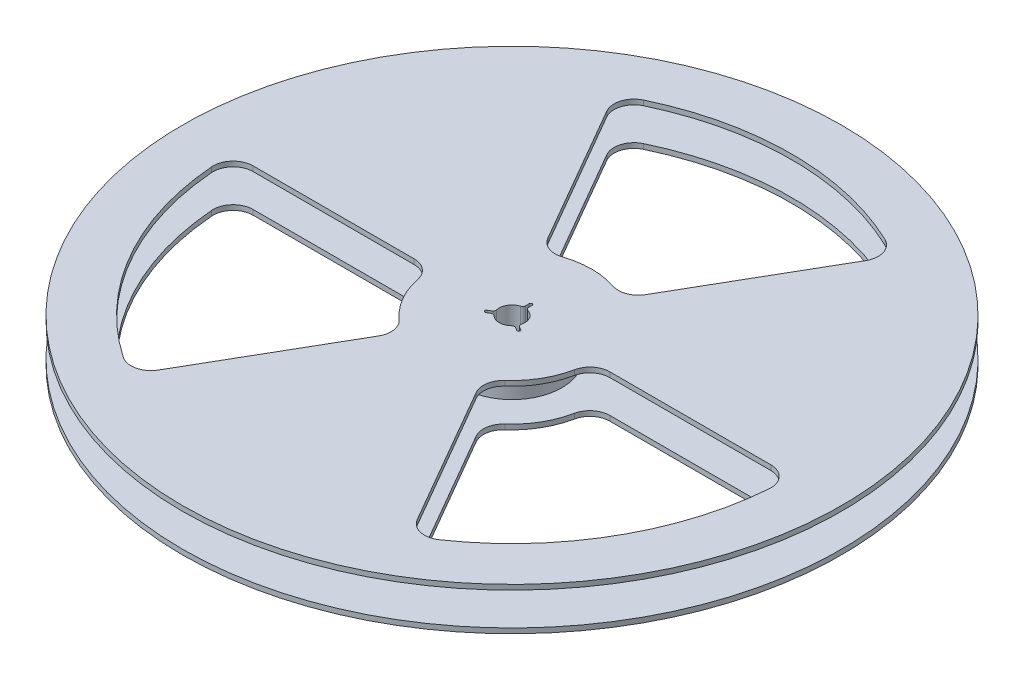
from build123d import *

# Parameters (mm, degrees)
CUT_EXTRUDE1_DEPTH = 235.324475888
CUT_EXTRUDE2_DEPTH = 235.324475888


with BuildPart() as part:
    # Sketch1 → Revolve1 (revolve)
    with BuildSketch(Plane.XY, mode=Mode.PRIVATE) as revolve1_sk:
        Polygon((0, 8.2), (0, -8.2), (0, -10.7), (165, -10.7), (165, -8.2), (25, -8.2), (25, 8.2), (165, 8.2), (165, 10.7), (0, 10.7), align=None)
    revolve(revolve1_sk.sketch.rotate(Axis((0, 8.2, 0), (0, -1, 0)), 90), axis=Axis((0, 8.2, 0), (0, -1, 0)))

    # Sketch2 → Cut-Extrude1 (cut, through all)
    with BuildSketch(Plane(origin=(0, 10.7, 0), x_dir=(1, 0, 0), z_dir=(0, 1, 0))):
        with BuildLine():
            Line((-0.75, 9.35), (-0.75, 7.572813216))
            ThreePointArc((-0.75, 7.572813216), (-1.047747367, 6.675824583), (-1.82278481, 6.134937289))
            ThreePointArc((-1.82278481, 6.134937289), (-5.542562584, 3.2), (-6.224403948, -1.488890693))
            ThreePointArc((-6.224403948, -1.488890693), (-6.305307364, -2.430536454), (-6.933248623, -3.136887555))
            Line((-6.933248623, -3.136887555), (-8.472337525, -4.025480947))
            ThreePointArc((-8.472337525, -4.025480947), (-8.746856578, -5.05), (-7.722337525, -5.324519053))
            Line((-7.722337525, -5.324519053), (-6.183248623, -4.435925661))
            ThreePointArc((-6.183248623, -4.435925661), (-5.257559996, -4.245288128), (-4.401619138, -4.646046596))
            ThreePointArc((-4.401619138, -4.646046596), (0, -6.4), (4.401619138, -4.646046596))
            ThreePointArc((4.401619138, -4.646046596), (5.257559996, -4.245288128), (6.183248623, -4.435925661))
            Line((6.183248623, -4.435925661), (7.722337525, -5.324519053))
            ThreePointArc((7.722337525, -5.324519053), (8.746856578, -5.05), (8.472337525, -4.025480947))
            Line((8.472337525, -4.025480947), (6.933248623, -3.136887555))
            ThreePointArc((6.933248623, -3.136887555), (6.305307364, -2.430536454), (6.224403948, -1.488890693))
            ThreePointArc((6.224403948, -1.488890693), (5.542562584, 3.2), (1.82278481, 6.134937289))
            ThreePointArc((1.82278481, 6.134937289), (1.047747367, 6.675824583), (0.75, 7.572813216))
            Line((0.75, 7.572813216), (0.75, 9.35))
            ThreePointArc((0.75, 9.35), (0, 10.1), (-0.75, 9.35))
        make_face()
    extrude(amount=-CUT_EXTRUDE1_DEPTH, mode=Mode.SUBTRACT)

    # Sketch3 → Cut-Extrude2 (cut, through all)
    with BuildSketch(Plane(origin=(0, 10.7, 0), x_dir=(1, 0, 0), z_dir=(0, 1, 0))):
        with BuildLine():
            Line((48.989794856, 0), (129.614813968, 0))
            ThreePointArc((129.614813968, 0), (136.952807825, -3.206337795), (139.585184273, -10.769230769))
            ThreePointArc((139.585184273, -10.769230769), (121.24355653, -70), (79.119019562, -115.499700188))
            ThreePointArc((79.119019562, -115.499700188), (71.253173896, -117.001441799), (64.807406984, -112.249721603))
            Line((64.807406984, -112.249721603), (24.494897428, -42.426406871))
            ThreePointArc((24.494897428, -42.426406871), (23.284669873, -35.822164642), (26.524121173, -29.941125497))
            ThreePointArc((26.524121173, -29.941125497), (34.641016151, -20), (39.191835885, -8))
            ThreePointArc((39.191835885, -8), (42.665239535, -2.254033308), (48.989794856, 0))
        make_face()
        with BuildLine():
            Line((-48.989794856, 0), (-129.614813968, 0))
            ThreePointArc((-129.614813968, 0), (-136.952807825, -3.206337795), (-139.585184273, -10.769230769))
            ThreePointArc((-139.585184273, -10.769230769), (-121.24355653, -70), (-79.119019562, -115.499700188))
            ThreePointArc((-79.119019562, -115.499700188), (-71.253173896, -117.001441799), (-64.807406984, -112.249721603))
            Line((-64.807406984, -112.249721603), (-24.494897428, -42.426406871))
            ThreePointArc((-24.494897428, -42.426406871), (-23.284669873, -35.822164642), (-26.524121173, -29.941125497))
            ThreePointArc((-26.524121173, -29.941125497), (-34.641016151, -20), (-39.191835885, -8))
            ThreePointArc((-39.191835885, -8), (-42.665239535, -2.254033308), (-48.989794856, 0))
        make_face()
        with BuildLine():
            Line((24.494897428, 42.426406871), (64.807406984, 112.249721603))
            ThreePointArc((64.807406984, 112.249721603), (65.699633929, 120.207779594), (60.466164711, 126.268930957))
            ThreePointArc((60.466164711, 126.268930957), (0, 140), (-60.466164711, 126.268930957))
            ThreePointArc((-60.466164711, 126.268930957), (-65.699633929, 120.207779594), (-64.807406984, 112.249721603))
            Line((-64.807406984, 112.249721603), (-24.494897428, 42.426406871))
            ThreePointArc((-24.494897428, 42.426406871), (-19.380569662, 38.07619795), (-12.667714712, 37.941125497))
            ThreePointArc((-12.667714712, 37.941125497), (0, 40), (12.667714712, 37.941125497))
            ThreePointArc((12.667714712, 37.941125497), (19.380569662, 38.07619795), (24.494897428, 42.426406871))
        make_face()
    extrude(amount=-CUT_EXTRUDE2_DEPTH, mode=Mode.SUBTRACT)


solid = part.part
